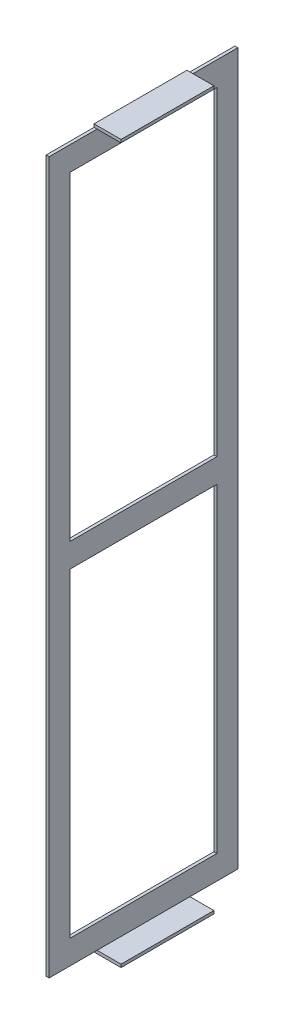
ISO-10303-21;
HEADER;
FILE_DESCRIPTION(('STEP AP214'),'2;1');
FILE_NAME('part.step','',(''),(''),'','','');
FILE_SCHEMA(('AUTOMOTIVE_DESIGN { 1 0 10303 214 1 1 1 1 }'));
ENDSEC;
DATA;
#1=APPLICATION_CONTEXT('core data for automotive mechanical design processes');
#2=APPLICATION_PROTOCOL_DEFINITION('international standard','automotive_design',2000,#1);
#3=PRODUCT_CONTEXT('',#1,'mechanical');
#4=PRODUCT('Part','Part','',(#3));
#5=PRODUCT_RELATED_PRODUCT_CATEGORY('part','',(#4));
#6=PRODUCT_DEFINITION_FORMATION('','',#4);
#7=PRODUCT_DEFINITION_CONTEXT('part definition',#1,'design');
#8=PRODUCT_DEFINITION('design','',#6,#7);
#9=PRODUCT_DEFINITION_SHAPE('','',#8);
#10=(LENGTH_UNIT() NAMED_UNIT(*) SI_UNIT(.MILLI.,.METRE.));
#11=(NAMED_UNIT(*) PLANE_ANGLE_UNIT() SI_UNIT($,.RADIAN.));
#12=(NAMED_UNIT(*) SI_UNIT($,.STERADIAN.) SOLID_ANGLE_UNIT());
#13=UNCERTAINTY_MEASURE_WITH_UNIT(LENGTH_MEASURE(1.E-05),#10,'distance_accuracy_value','');
#14=(GEOMETRIC_REPRESENTATION_CONTEXT(3) GLOBAL_UNCERTAINTY_ASSIGNED_CONTEXT((#13)) GLOBAL_UNIT_ASSIGNED_CONTEXT((#10,
#11,#12)) REPRESENTATION_CONTEXT('',''));
#15=CARTESIAN_POINT('',(0.,0.,0.));
#16=DIRECTION('',(0.,0.,1.));
#17=DIRECTION('',(1.,0.,0.));
#18=AXIS2_PLACEMENT_3D('',#15,#16,#17);
#19=CARTESIAN_POINT('',(0.,0.,0.));
#20=DIRECTION('',(0.,-1.,0.));
#21=DIRECTION('',(0.,0.,-1.));
#22=AXIS2_PLACEMENT_3D('',#19,#20,#21);
#23=PLANE('',#22);
#24=DIRECTION('',(0.,0.,-1.));
#25=VECTOR('',#24,1.);
#26=CARTESIAN_POINT('',(50.,0.,-50.));
#27=LINE('',#26,#25);
#28=CARTESIAN_POINT('',(50.,0.,50.));
#29=VERTEX_POINT('',#28);
#30=CARTESIAN_POINT('',(50.,0.,24.6));
#31=VERTEX_POINT('',#30);
#32=EDGE_CURVE('E275',#29,#31,#27,.T.);
#33=ORIENTED_EDGE('',*,*,#32,.T.);
#34=DIRECTION('',(1.,0.,0.));
#35=VECTOR('',#34,1.);
#36=CARTESIAN_POINT('',(50.,0.,24.6));
#37=LINE('',#36,#35);
#38=CARTESIAN_POINT('',(51.5875,0.,24.6));
#39=VERTEX_POINT('',#38);
#40=EDGE_CURVE('E222',#31,#39,#37,.T.);
#41=ORIENTED_EDGE('',*,*,#40,.T.);
#42=DIRECTION('',(0.,0.,-1.));
#43=VECTOR('',#42,1.);
#44=CARTESIAN_POINT('',(51.5875,0.,-51.5875));
#45=LINE('',#44,#43);
#46=CARTESIAN_POINT('',(51.5875,0.,50.));
#47=VERTEX_POINT('',#46);
#48=EDGE_CURVE('E265',#47,#39,#45,.T.);
#49=ORIENTED_EDGE('',*,*,#48,.F.);
#50=DIRECTION('',(1.,0.,0.));
#51=VECTOR('',#50,1.);
#52=CARTESIAN_POINT('',(-51.6,0.,50.));
#53=LINE('',#52,#51);
#54=EDGE_CURVE('E324',#29,#47,#53,.T.);
#55=ORIENTED_EDGE('',*,*,#54,.F.);
#56=EDGE_LOOP('',(#33,#41,#49,#55));
#57=FACE_BOUND('',#56,.T.);
#58=ADVANCED_FACE('F37',(#57),#23,.T.);
#59=CARTESIAN_POINT('',(51.5875,0.,-24.6));
#60=VERTEX_POINT('',#59);
#61=CARTESIAN_POINT('',(51.5875,0.,-50.));
#62=VERTEX_POINT('',#61);
#63=EDGE_CURVE('E258',#60,#62,#45,.T.);
#64=ORIENTED_EDGE('',*,*,#63,.F.);
#65=DIRECTION('',(-1.,0.,0.));
#66=VECTOR('',#65,1.);
#67=CARTESIAN_POINT('',(50.,0.,-24.6));
#68=LINE('',#67,#66);
#69=CARTESIAN_POINT('',(50.,0.,-24.6));
#70=VERTEX_POINT('',#69);
#71=EDGE_CURVE('E229',#60,#70,#68,.T.);
#72=ORIENTED_EDGE('',*,*,#71,.T.);
#73=CARTESIAN_POINT('',(50.,0.,-50.));
#74=VERTEX_POINT('',#73);
#75=EDGE_CURVE('E233',#70,#74,#27,.T.);
#76=ORIENTED_EDGE('',*,*,#75,.T.);
#77=DIRECTION('',(1.,0.,0.));
#78=VECTOR('',#77,1.);
#79=CARTESIAN_POINT('',(-51.6,0.,-50.));
#80=LINE('',#79,#78);
#81=EDGE_CURVE('E261',#74,#62,#80,.T.);
#82=ORIENTED_EDGE('',*,*,#81,.T.);
#83=EDGE_LOOP('',(#64,#72,#76,#82));
#84=FACE_BOUND('',#83,.T.);
#85=ADVANCED_FACE('F259',(#84),#23,.T.);
#86=CARTESIAN_POINT('',(51.5875,376.8,-51.5875));
#87=DIRECTION('',(-1.,0.,0.));
#88=DIRECTION('',(0.,0.,1.));
#89=AXIS2_PLACEMENT_3D('',#86,#87,#88);
#90=PLANE('',#89);
#91=DIRECTION('',(0.,1.,0.));
#92=VECTOR('',#91,1.);
#93=CARTESIAN_POINT('',(51.5875,364.1,-38.8875));
#94=LINE('',#93,#92);
#95=CARTESIAN_POINT('',(51.5875000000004,194.75,-38.8874999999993));
#96=VERTEX_POINT('',#95);
#97=CARTESIAN_POINT('',(51.5875,364.1,-38.8875));
#98=VERTEX_POINT('',#97);
#99=EDGE_CURVE('E359',#96,#98,#94,.T.);
#100=ORIENTED_EDGE('',*,*,#99,.F.);
#101=DIRECTION('',(0.,0.,-1.));
#102=VECTOR('',#101,1.);
#103=CARTESIAN_POINT('',(51.5875,194.75,5.40350380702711E-13));
#104=LINE('',#103,#102);
#105=CARTESIAN_POINT('',(51.5875,194.75,38.8875));
#106=VERTEX_POINT('',#105);
#107=EDGE_CURVE('E328',#106,#96,#104,.T.);
#108=ORIENTED_EDGE('',*,*,#107,.F.);
#109=DIRECTION('',(0.,-1.,0.));
#110=VECTOR('',#109,1.);
#111=CARTESIAN_POINT('',(51.5875,364.1,38.8875));
#112=LINE('',#111,#110);
#113=CARTESIAN_POINT('',(51.5875,364.1,38.8875));
#114=VERTEX_POINT('',#113);
#115=EDGE_CURVE('E354',#114,#106,#112,.T.);
#116=ORIENTED_EDGE('',*,*,#115,.F.);
#117=DIRECTION('',(0.,0.,1.));
#118=VECTOR('',#117,1.);
#119=CARTESIAN_POINT('',(51.5875,364.1,38.8875));
#120=LINE('',#119,#118);
#121=EDGE_CURVE('E362',#98,#114,#120,.T.);
#122=ORIENTED_EDGE('',*,*,#121,.F.);
#123=EDGE_LOOP('',(#100,#108,#116,#122));
#124=FACE_BOUND('',#123,.T.);
#125=DIRECTION('',(0.,0.,-1.));
#126=VECTOR('',#125,1.);
#127=CARTESIAN_POINT('',(51.5875,182.05,5.40350380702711E-13));
#128=LINE('',#127,#126);
#129=CARTESIAN_POINT('',(51.5874999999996,182.05,38.8875000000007));
#130=VERTEX_POINT('',#129);
#131=CARTESIAN_POINT('',(51.5875,182.05,-38.8875));
#132=VERTEX_POINT('',#131);
#133=EDGE_CURVE('E334',#130,#132,#128,.T.);
#134=ORIENTED_EDGE('',*,*,#133,.T.);
#135=CARTESIAN_POINT('',(51.5875,12.7,-38.8875));
#136=VERTEX_POINT('',#135);
#137=EDGE_CURVE('E360',#136,#132,#94,.T.);
#138=ORIENTED_EDGE('',*,*,#137,.F.);
#139=DIRECTION('',(0.,0.,-1.));
#140=VECTOR('',#139,1.);
#141=CARTESIAN_POINT('',(51.5875,12.7,38.8875));
#142=LINE('',#141,#140);
#143=CARTESIAN_POINT('',(51.5875,12.7,38.8875));
#144=VERTEX_POINT('',#143);
#145=EDGE_CURVE('E356',#144,#136,#142,.T.);
#146=ORIENTED_EDGE('',*,*,#145,.F.);
#147=EDGE_CURVE('E345',#130,#144,#112,.T.);
#148=ORIENTED_EDGE('',*,*,#147,.F.);
#149=EDGE_LOOP('',(#134,#138,#146,#148));
#150=FACE_BOUND('',#149,.T.);
#151=ORIENTED_EDGE('',*,*,#48,.T.);
#152=DIRECTION('',(0.,0.,-1.));
#153=VECTOR('',#152,1.);
#154=CARTESIAN_POINT('',(51.5875,0.,24.6));
#155=LINE('',#154,#153);
#156=EDGE_CURVE('E211',#39,#60,#155,.T.);
#157=ORIENTED_EDGE('',*,*,#156,.T.);
#158=ORIENTED_EDGE('',*,*,#63,.T.);
#159=DIRECTION('',(0.,-1.,0.));
#160=VECTOR('',#159,1.);
#161=CARTESIAN_POINT('',(51.5875,0.,-50.));
#162=LINE('',#161,#160);
#163=CARTESIAN_POINT('',(51.5875,376.8,-50.));
#164=VERTEX_POINT('',#163);
#165=EDGE_CURVE('E316',#164,#62,#162,.T.);
#166=ORIENTED_EDGE('',*,*,#165,.F.);
#167=DIRECTION('',(0.,0.,-1.));
#168=VECTOR('',#167,1.);
#169=CARTESIAN_POINT('',(51.5875,376.8,-51.5875));
#170=LINE('',#169,#168);
#171=CARTESIAN_POINT('',(51.5875,376.8,-24.6));
#172=VERTEX_POINT('',#171);
#173=EDGE_CURVE('E269',#172,#164,#170,.T.);
#174=ORIENTED_EDGE('',*,*,#173,.F.);
#175=DIRECTION('',(0.,0.,-1.));
#176=VECTOR('',#175,1.);
#177=CARTESIAN_POINT('',(51.5875,376.8,24.6));
#178=LINE('',#177,#176);
#179=CARTESIAN_POINT('',(51.5875,376.8,24.6));
#180=VERTEX_POINT('',#179);
#181=EDGE_CURVE('E237',#180,#172,#178,.T.);
#182=ORIENTED_EDGE('',*,*,#181,.F.);
#183=CARTESIAN_POINT('',(51.5875,376.8,50.));
#184=VERTEX_POINT('',#183);
#185=EDGE_CURVE('E284',#184,#180,#170,.T.);
#186=ORIENTED_EDGE('',*,*,#185,.F.);
#187=DIRECTION('',(0.,1.,0.));
#188=VECTOR('',#187,1.);
#189=CARTESIAN_POINT('',(51.5875,376.8,50.));
#190=LINE('',#189,#188);
#191=EDGE_CURVE('E318',#47,#184,#190,.T.);
#192=ORIENTED_EDGE('',*,*,#191,.F.);
#193=EDGE_LOOP('',(#151,#157,#158,#166,#174,#182,#186,#192));
#194=FACE_BOUND('',#193,.T.);
#195=ADVANCED_FACE('F39',(#124,#150,#194),#90,.F.);
#196=CARTESIAN_POINT('',(0.,376.8,0.));
#197=DIRECTION('',(0.,-1.,0.));
#198=DIRECTION('',(0.,0.,-1.));
#199=AXIS2_PLACEMENT_3D('',#196,#197,#198);
#200=PLANE('',#199);
#201=DIRECTION('',(-1.,0.,0.));
#202=VECTOR('',#201,1.);
#203=CARTESIAN_POINT('',(50.,376.8,-24.6));
#204=LINE('',#203,#202);
#205=CARTESIAN_POINT('',(50.,376.8,-24.6));
#206=VERTEX_POINT('',#205);
#207=EDGE_CURVE('E681',#172,#206,#204,.T.);
#208=ORIENTED_EDGE('',*,*,#207,.F.);
#209=ORIENTED_EDGE('',*,*,#173,.T.);
#210=DIRECTION('',(1.,0.,0.));
#211=VECTOR('',#210,1.);
#212=CARTESIAN_POINT('',(-51.6,376.8,-50.));
#213=LINE('',#212,#211);
#214=CARTESIAN_POINT('',(50.,376.8,-50.));
#215=VERTEX_POINT('',#214);
#216=EDGE_CURVE('E314',#215,#164,#213,.T.);
#217=ORIENTED_EDGE('',*,*,#216,.F.);
#218=DIRECTION('',(0.,0.,-1.));
#219=VECTOR('',#218,1.);
#220=CARTESIAN_POINT('',(50.,376.8,-50.));
#221=LINE('',#220,#219);
#222=EDGE_CURVE('E62',#206,#215,#221,.T.);
#223=ORIENTED_EDGE('',*,*,#222,.F.);
#224=EDGE_LOOP('',(#208,#209,#217,#223));
#225=FACE_BOUND('',#224,.T.);
#226=ADVANCED_FACE('F315',(#225),#200,.F.);
#227=DIRECTION('',(1.,0.,0.));
#228=VECTOR('',#227,1.);
#229=CARTESIAN_POINT('',(50.,376.8,24.6));
#230=LINE('',#229,#228);
#231=CARTESIAN_POINT('',(50.,376.8,24.6));
#232=VERTEX_POINT('',#231);
#233=EDGE_CURVE('E677',#232,#180,#230,.T.);
#234=ORIENTED_EDGE('',*,*,#233,.F.);
#235=CARTESIAN_POINT('',(50.,376.8,50.));
#236=VERTEX_POINT('',#235);
#237=EDGE_CURVE('E292',#236,#232,#221,.T.);
#238=ORIENTED_EDGE('',*,*,#237,.F.);
#239=DIRECTION('',(1.,0.,0.));
#240=VECTOR('',#239,1.);
#241=CARTESIAN_POINT('',(-51.6,376.8,50.));
#242=LINE('',#241,#240);
#243=EDGE_CURVE('E325',#236,#184,#242,.T.);
#244=ORIENTED_EDGE('',*,*,#243,.T.);
#245=ORIENTED_EDGE('',*,*,#185,.T.);
#246=EDGE_LOOP('',(#234,#238,#244,#245));
#247=FACE_BOUND('',#246,.T.);
#248=ADVANCED_FACE('F418',(#247),#200,.F.);
#249=CARTESIAN_POINT('',(-51.6,376.8,50.));
#250=DIRECTION('',(0.,0.,-1.));
#251=DIRECTION('',(-1.,0.,0.));
#252=AXIS2_PLACEMENT_3D('',#249,#250,#251);
#253=PLANE('',#252);
#254=DIRECTION('',(0.,-1.,0.));
#255=VECTOR('',#254,1.);
#256=CARTESIAN_POINT('',(50.,376.8,50.));
#257=LINE('',#256,#255);
#258=EDGE_CURVE('E266',#236,#29,#257,.T.);
#259=ORIENTED_EDGE('',*,*,#258,.T.);
#260=ORIENTED_EDGE('',*,*,#54,.T.);
#261=ORIENTED_EDGE('',*,*,#191,.T.);
#262=ORIENTED_EDGE('',*,*,#243,.F.);
#263=EDGE_LOOP('',(#259,#260,#261,#262));
#264=FACE_BOUND('',#263,.T.);
#265=ADVANCED_FACE('F407',(#264),#253,.F.);
#266=CARTESIAN_POINT('',(-51.6,364.1,38.8875));
#267=DIRECTION('',(0.,0.,1.));
#268=DIRECTION('',(1.,0.,0.));
#269=AXIS2_PLACEMENT_3D('',#266,#267,#268);
#270=PLANE('',#269);
#271=DIRECTION('',(1.,0.,0.));
#272=VECTOR('',#271,1.);
#273=CARTESIAN_POINT('',(49.9999999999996,194.75,38.8875000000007));
#274=LINE('',#273,#272);
#275=CARTESIAN_POINT('',(50.,194.75,38.8875));
#276=VERTEX_POINT('',#275);
#277=EDGE_CURVE('E337',#276,#106,#274,.T.);
#278=ORIENTED_EDGE('',*,*,#277,.F.);
#279=DIRECTION('',(0.,1.,0.));
#280=VECTOR('',#279,1.);
#281=CARTESIAN_POINT('',(50.,376.8,38.8875));
#282=LINE('',#281,#280);
#283=CARTESIAN_POINT('',(50.,364.1,38.8875));
#284=VERTEX_POINT('',#283);
#285=EDGE_CURVE('E46',#276,#284,#282,.T.);
#286=ORIENTED_EDGE('',*,*,#285,.T.);
#287=DIRECTION('',(1.,0.,0.));
#288=VECTOR('',#287,1.);
#289=CARTESIAN_POINT('',(-51.6,364.1,38.8875));
#290=LINE('',#289,#288);
#291=EDGE_CURVE('E365',#284,#114,#290,.T.);
#292=ORIENTED_EDGE('',*,*,#291,.T.);
#293=ORIENTED_EDGE('',*,*,#115,.T.);
#294=EDGE_LOOP('',(#278,#286,#292,#293));
#295=FACE_BOUND('',#294,.T.);
#296=ADVANCED_FACE('F394',(#295),#270,.F.);
#297=CARTESIAN_POINT('',(-51.6,364.1,38.8875));
#298=DIRECTION('',(0.,1.,0.));
#299=DIRECTION('',(0.,0.,1.));
#300=AXIS2_PLACEMENT_3D('',#297,#298,#299);
#301=PLANE('',#300);
#302=DIRECTION('',(0.,0.,-1.));
#303=VECTOR('',#302,1.);
#304=CARTESIAN_POINT('',(50.,364.1,-50.));
#305=LINE('',#304,#303);
#306=CARTESIAN_POINT('',(50.,364.1,-38.8875));
#307=VERTEX_POINT('',#306);
#308=EDGE_CURVE('E287',#284,#307,#305,.T.);
#309=ORIENTED_EDGE('',*,*,#308,.T.);
#310=DIRECTION('',(1.,0.,0.));
#311=VECTOR('',#310,1.);
#312=CARTESIAN_POINT('',(-51.6,364.1,-38.8875));
#313=LINE('',#312,#311);
#314=EDGE_CURVE('E367',#307,#98,#313,.T.);
#315=ORIENTED_EDGE('',*,*,#314,.T.);
#316=ORIENTED_EDGE('',*,*,#121,.T.);
#317=ORIENTED_EDGE('',*,*,#291,.F.);
#318=EDGE_LOOP('',(#309,#315,#316,#317));
#319=FACE_BOUND('',#318,.T.);
#320=ADVANCED_FACE('F406',(#319),#301,.F.);
#321=CARTESIAN_POINT('',(-51.6,364.1,-38.8875));
#322=DIRECTION('',(0.,0.,-1.));
#323=DIRECTION('',(-1.,0.,0.));
#324=AXIS2_PLACEMENT_3D('',#321,#322,#323);
#325=PLANE('',#324);
#326=DIRECTION('',(1.,0.,0.));
#327=VECTOR('',#326,1.);
#328=CARTESIAN_POINT('',(50.0000000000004,194.75,-38.8874999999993));
#329=LINE('',#328,#327);
#330=CARTESIAN_POINT('',(50.,194.75,-38.8875));
#331=VERTEX_POINT('',#330);
#332=EDGE_CURVE('E342',#331,#96,#329,.T.);
#333=ORIENTED_EDGE('',*,*,#332,.T.);
#334=ORIENTED_EDGE('',*,*,#99,.T.);
#335=ORIENTED_EDGE('',*,*,#314,.F.);
#336=DIRECTION('',(0.,-1.,0.));
#337=VECTOR('',#336,1.);
#338=CARTESIAN_POINT('',(50.,376.8,-38.8875));
#339=LINE('',#338,#337);
#340=EDGE_CURVE('E285',#307,#331,#339,.T.);
#341=ORIENTED_EDGE('',*,*,#340,.T.);
#342=EDGE_LOOP('',(#333,#334,#335,#341));
#343=FACE_BOUND('',#342,.T.);
#344=ADVANCED_FACE('F429',(#343),#325,.F.);
#345=CARTESIAN_POINT('',(50.,194.75,5.2372220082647E-13));
#346=DIRECTION('',(0.,-1.,0.));
#347=DIRECTION('',(0.,0.,-1.));
#348=AXIS2_PLACEMENT_3D('',#345,#346,#347);
#349=PLANE('',#348);
#350=ORIENTED_EDGE('',*,*,#107,.T.);
#351=ORIENTED_EDGE('',*,*,#332,.F.);
#352=DIRECTION('',(0.,0.,-1.));
#353=VECTOR('',#352,1.);
#354=CARTESIAN_POINT('',(50.,194.75,5.2372220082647E-13));
#355=LINE('',#354,#353);
#356=EDGE_CURVE('E330',#276,#331,#355,.T.);
#357=ORIENTED_EDGE('',*,*,#356,.F.);
#358=ORIENTED_EDGE('',*,*,#277,.T.);
#359=EDGE_LOOP('',(#350,#351,#357,#358));
#360=FACE_BOUND('',#359,.T.);
#361=ADVANCED_FACE('F402',(#360),#349,.F.);
#362=CARTESIAN_POINT('',(-51.6,12.7,38.8875));
#363=DIRECTION('',(0.,-1.,0.));
#364=DIRECTION('',(0.,0.,-1.));
#365=AXIS2_PLACEMENT_3D('',#362,#363,#364);
#366=PLANE('',#365);
#367=DIRECTION('',(0.,0.,1.));
#368=VECTOR('',#367,1.);
#369=CARTESIAN_POINT('',(50.,12.7,-50.));
#370=LINE('',#369,#368);
#371=CARTESIAN_POINT('',(50.,12.7,-38.8875));
#372=VERTEX_POINT('',#371);
#373=CARTESIAN_POINT('',(50.,12.7,38.8875));
#374=VERTEX_POINT('',#373);
#375=EDGE_CURVE('E280',#372,#374,#370,.T.);
#376=ORIENTED_EDGE('',*,*,#375,.T.);
#377=DIRECTION('',(1.,0.,0.));
#378=VECTOR('',#377,1.);
#379=CARTESIAN_POINT('',(-51.6,12.7,38.8875));
#380=LINE('',#379,#378);
#381=EDGE_CURVE('E299',#374,#144,#380,.T.);
#382=ORIENTED_EDGE('',*,*,#381,.T.);
#383=ORIENTED_EDGE('',*,*,#145,.T.);
#384=DIRECTION('',(1.,0.,0.));
#385=VECTOR('',#384,1.);
#386=CARTESIAN_POINT('',(-51.6,12.7,-38.8875));
#387=LINE('',#386,#385);
#388=EDGE_CURVE('E369',#372,#136,#387,.T.);
#389=ORIENTED_EDGE('',*,*,#388,.F.);
#390=EDGE_LOOP('',(#376,#382,#383,#389));
#391=FACE_BOUND('',#390,.T.);
#392=ADVANCED_FACE('F376',(#391),#366,.F.);
#393=CARTESIAN_POINT('',(50.,182.05,38.8875));
#394=VERTEX_POINT('',#393);
#395=EDGE_CURVE('E11',#374,#394,#282,.T.);
#396=ORIENTED_EDGE('',*,*,#395,.T.);
#397=DIRECTION('',(1.,0.,0.));
#398=VECTOR('',#397,1.);
#399=CARTESIAN_POINT('',(49.9999999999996,182.05,38.8875000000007));
#400=LINE('',#399,#398);
#401=EDGE_CURVE('E349',#394,#130,#400,.T.);
#402=ORIENTED_EDGE('',*,*,#401,.T.);
#403=ORIENTED_EDGE('',*,*,#147,.T.);
#404=ORIENTED_EDGE('',*,*,#381,.F.);
#405=EDGE_LOOP('',(#396,#402,#403,#404));
#406=FACE_BOUND('',#405,.T.);
#407=ADVANCED_FACE('F391',(#406),#270,.F.);
#408=CARTESIAN_POINT('',(50.,182.05,5.2372220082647E-13));
#409=DIRECTION('',(0.,-1.,0.));
#410=DIRECTION('',(0.,0.,-1.));
#411=AXIS2_PLACEMENT_3D('',#408,#409,#410);
#412=PLANE('',#411);
#413=ORIENTED_EDGE('',*,*,#133,.F.);
#414=ORIENTED_EDGE('',*,*,#401,.F.);
#415=DIRECTION('',(0.,0.,-1.));
#416=VECTOR('',#415,1.);
#417=CARTESIAN_POINT('',(50.,182.05,5.2372220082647E-13));
#418=LINE('',#417,#416);
#419=CARTESIAN_POINT('',(50.,182.05,-38.8875));
#420=VERTEX_POINT('',#419);
#421=EDGE_CURVE('E333',#394,#420,#418,.T.);
#422=ORIENTED_EDGE('',*,*,#421,.T.);
#423=DIRECTION('',(1.,0.,0.));
#424=VECTOR('',#423,1.);
#425=CARTESIAN_POINT('',(50.0000000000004,182.05,-38.8874999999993));
#426=LINE('',#425,#424);
#427=EDGE_CURVE('E346',#420,#132,#426,.T.);
#428=ORIENTED_EDGE('',*,*,#427,.T.);
#429=EDGE_LOOP('',(#413,#414,#422,#428));
#430=FACE_BOUND('',#429,.T.);
#431=ADVANCED_FACE('F386',(#430),#412,.T.);
#432=ORIENTED_EDGE('',*,*,#137,.T.);
#433=ORIENTED_EDGE('',*,*,#427,.F.);
#434=EDGE_CURVE('E283',#420,#372,#339,.T.);
#435=ORIENTED_EDGE('',*,*,#434,.T.);
#436=ORIENTED_EDGE('',*,*,#388,.T.);
#437=EDGE_LOOP('',(#432,#433,#435,#436));
#438=FACE_BOUND('',#437,.T.);
#439=ADVANCED_FACE('F383',(#438),#325,.F.);
#440=CARTESIAN_POINT('',(50.,376.8,-50.));
#441=DIRECTION('',(-1.,0.,0.));
#442=DIRECTION('',(0.,0.,1.));
#443=AXIS2_PLACEMENT_3D('',#440,#441,#442);
#444=PLANE('',#443);
#445=ORIENTED_EDGE('',*,*,#434,.F.);
#446=ORIENTED_EDGE('',*,*,#421,.F.);
#447=ORIENTED_EDGE('',*,*,#395,.F.);
#448=ORIENTED_EDGE('',*,*,#375,.F.);
#449=EDGE_LOOP('',(#445,#446,#447,#448));
#450=FACE_BOUND('',#449,.T.);
#451=ORIENTED_EDGE('',*,*,#356,.T.);
#452=ORIENTED_EDGE('',*,*,#340,.F.);
#453=ORIENTED_EDGE('',*,*,#308,.F.);
#454=ORIENTED_EDGE('',*,*,#285,.F.);
#455=EDGE_LOOP('',(#451,#452,#453,#454));
#456=FACE_BOUND('',#455,.T.);
#457=ORIENTED_EDGE('',*,*,#32,.F.);
#458=ORIENTED_EDGE('',*,*,#258,.F.);
#459=ORIENTED_EDGE('',*,*,#237,.T.);
#460=DIRECTION('',(0.,-1.,0.));
#461=VECTOR('',#460,1.);
#462=CARTESIAN_POINT('',(50.,378.3875,24.6));
#463=LINE('',#462,#461);
#464=CARTESIAN_POINT('',(50.,378.3875,24.6));
#465=VERTEX_POINT('',#464);
#466=EDGE_CURVE('E320',#465,#232,#463,.T.);
#467=ORIENTED_EDGE('',*,*,#466,.F.);
#468=DIRECTION('',(0.,0.,1.));
#469=VECTOR('',#468,1.);
#470=CARTESIAN_POINT('',(50.,378.3875,-24.6));
#471=LINE('',#470,#469);
#472=CARTESIAN_POINT('',(50.,378.3875,-24.6));
#473=VERTEX_POINT('',#472);
#474=EDGE_CURVE('E696',#473,#465,#471,.T.);
#475=ORIENTED_EDGE('',*,*,#474,.F.);
#476=DIRECTION('',(0.,-1.,0.));
#477=VECTOR('',#476,1.);
#478=CARTESIAN_POINT('',(50.,378.3875,-24.6));
#479=LINE('',#478,#477);
#480=EDGE_CURVE('E703',#473,#206,#479,.T.);
#481=ORIENTED_EDGE('',*,*,#480,.T.);
#482=ORIENTED_EDGE('',*,*,#222,.T.);
#483=DIRECTION('',(0.,-1.,0.));
#484=VECTOR('',#483,1.);
#485=CARTESIAN_POINT('',(50.,376.8,-50.));
#486=LINE('',#485,#484);
#487=EDGE_CURVE('E271',#215,#74,#486,.T.);
#488=ORIENTED_EDGE('',*,*,#487,.T.);
#489=ORIENTED_EDGE('',*,*,#75,.F.);
#490=DIRECTION('',(0.,1.,0.));
#491=VECTOR('',#490,1.);
#492=CARTESIAN_POINT('',(50.,-1.5875,-24.6));
#493=LINE('',#492,#491);
#494=CARTESIAN_POINT('',(50.,-1.5875,-24.6));
#495=VERTEX_POINT('',#494);
#496=EDGE_CURVE('E54',#495,#70,#493,.T.);
#497=ORIENTED_EDGE('',*,*,#496,.F.);
#498=DIRECTION('',(0.,0.,1.));
#499=VECTOR('',#498,1.);
#500=CARTESIAN_POINT('',(50.,-1.5875,-24.6));
#501=LINE('',#500,#499);
#502=CARTESIAN_POINT('',(50.,-1.5875,24.6));
#503=VERTEX_POINT('',#502);
#504=EDGE_CURVE('E220',#495,#503,#501,.T.);
#505=ORIENTED_EDGE('',*,*,#504,.T.);
#506=DIRECTION('',(0.,1.,0.));
#507=VECTOR('',#506,1.);
#508=CARTESIAN_POINT('',(50.,-1.5875,24.6));
#509=LINE('',#508,#507);
#510=EDGE_CURVE('E196',#503,#31,#509,.T.);
#511=ORIENTED_EDGE('',*,*,#510,.T.);
#512=EDGE_LOOP('',(#457,#458,#459,#467,#475,#481,#482,#488,#489,#497,#505,#511));
#513=FACE_BOUND('',#512,.T.);
#514=ADVANCED_FACE('F309',(#450,#456,#513),#444,.T.);
#515=CARTESIAN_POINT('',(-51.6,0.,-50.));
#516=DIRECTION('',(0.,0.,1.));
#517=DIRECTION('',(1.,0.,0.));
#518=AXIS2_PLACEMENT_3D('',#515,#516,#517);
#519=PLANE('',#518);
#520=ORIENTED_EDGE('',*,*,#487,.F.);
#521=ORIENTED_EDGE('',*,*,#216,.T.);
#522=ORIENTED_EDGE('',*,*,#165,.T.);
#523=ORIENTED_EDGE('',*,*,#81,.F.);
#524=EDGE_LOOP('',(#520,#521,#522,#523));
#525=FACE_BOUND('',#524,.T.);
#526=ADVANCED_FACE('F313',(#525),#519,.F.);
#527=CARTESIAN_POINT('',(50.,378.3875,24.6));
#528=DIRECTION('',(0.,0.,-1.));
#529=DIRECTION('',(-1.,0.,0.));
#530=AXIS2_PLACEMENT_3D('',#527,#528,#529);
#531=PLANE('',#530);
#532=ORIENTED_EDGE('',*,*,#233,.T.);
#533=DIRECTION('',(-1.,0.,0.));
#534=VECTOR('',#533,1.);
#535=CARTESIAN_POINT('',(64.2875,376.8,24.6));
#536=LINE('',#535,#534);
#537=CARTESIAN_POINT('',(64.2875,376.8,24.6));
#538=VERTEX_POINT('',#537);
#539=EDGE_CURVE('E675',#538,#180,#536,.T.);
#540=ORIENTED_EDGE('',*,*,#539,.F.);
#541=DIRECTION('',(0.,-1.,0.));
#542=VECTOR('',#541,1.);
#543=CARTESIAN_POINT('',(64.2875,378.3875,24.6));
#544=LINE('',#543,#542);
#545=CARTESIAN_POINT('',(64.2875,378.3875,24.6));
#546=VERTEX_POINT('',#545);
#547=EDGE_CURVE('E666',#546,#538,#544,.T.);
#548=ORIENTED_EDGE('',*,*,#547,.F.);
#549=DIRECTION('',(1.,0.,0.));
#550=VECTOR('',#549,1.);
#551=CARTESIAN_POINT('',(50.,378.3875,24.6));
#552=LINE('',#551,#550);
#553=EDGE_CURVE('E699',#465,#546,#552,.T.);
#554=ORIENTED_EDGE('',*,*,#553,.F.);
#555=ORIENTED_EDGE('',*,*,#466,.T.);
#556=EDGE_LOOP('',(#532,#540,#548,#554,#555));
#557=FACE_BOUND('',#556,.T.);
#558=ADVANCED_FACE('F425',(#557),#531,.F.);
#559=CARTESIAN_POINT('',(50.,378.3875,-24.6));
#560=DIRECTION('',(0.,0.,1.));
#561=DIRECTION('',(1.,0.,0.));
#562=AXIS2_PLACEMENT_3D('',#559,#560,#561);
#563=PLANE('',#562);
#564=ORIENTED_EDGE('',*,*,#207,.T.);
#565=ORIENTED_EDGE('',*,*,#480,.F.);
#566=DIRECTION('',(-1.,0.,0.));
#567=VECTOR('',#566,1.);
#568=CARTESIAN_POINT('',(50.,378.3875,-24.6));
#569=LINE('',#568,#567);
#570=CARTESIAN_POINT('',(64.2875,378.3875,-24.6));
#571=VERTEX_POINT('',#570);
#572=EDGE_CURVE('E701',#571,#473,#569,.T.);
#573=ORIENTED_EDGE('',*,*,#572,.F.);
#574=DIRECTION('',(0.,1.,0.));
#575=VECTOR('',#574,1.);
#576=CARTESIAN_POINT('',(64.2875,378.3875,-24.6));
#577=LINE('',#576,#575);
#578=CARTESIAN_POINT('',(64.2875,376.8,-24.6));
#579=VERTEX_POINT('',#578);
#580=EDGE_CURVE('E721',#579,#571,#577,.T.);
#581=ORIENTED_EDGE('',*,*,#580,.F.);
#582=DIRECTION('',(-1.,0.,0.));
#583=VECTOR('',#582,1.);
#584=CARTESIAN_POINT('',(64.2875,376.8,-24.6));
#585=LINE('',#584,#583);
#586=EDGE_CURVE('E679',#579,#172,#585,.T.);
#587=ORIENTED_EDGE('',*,*,#586,.T.);
#588=EDGE_LOOP('',(#564,#565,#573,#581,#587));
#589=FACE_BOUND('',#588,.T.);
#590=ADVANCED_FACE('F554',(#589),#563,.F.);
#591=CARTESIAN_POINT('',(0.,378.3875,0.));
#592=DIRECTION('',(0.,1.,0.));
#593=DIRECTION('',(0.,0.,1.));
#594=AXIS2_PLACEMENT_3D('',#591,#592,#593);
#595=PLANE('',#594);
#596=ORIENTED_EDGE('',*,*,#474,.T.);
#597=ORIENTED_EDGE('',*,*,#553,.T.);
#598=DIRECTION('',(0.,0.,1.));
#599=VECTOR('',#598,1.);
#600=CARTESIAN_POINT('',(64.2875,378.3875,24.6));
#601=LINE('',#600,#599);
#602=EDGE_CURVE('E672',#571,#546,#601,.T.);
#603=ORIENTED_EDGE('',*,*,#602,.F.);
#604=ORIENTED_EDGE('',*,*,#572,.T.);
#605=EDGE_LOOP('',(#596,#597,#603,#604));
#606=FACE_BOUND('',#605,.T.);
#607=ADVANCED_FACE('F565',(#606),#595,.T.);
#608=CARTESIAN_POINT('',(64.2875,376.8,24.6));
#609=DIRECTION('',(0.,1.,0.));
#610=DIRECTION('',(0.,0.,1.));
#611=AXIS2_PLACEMENT_3D('',#608,#609,#610);
#612=PLANE('',#611);
#613=ORIENTED_EDGE('',*,*,#181,.T.);
#614=ORIENTED_EDGE('',*,*,#586,.F.);
#615=DIRECTION('',(0.,0.,-1.));
#616=VECTOR('',#615,1.);
#617=CARTESIAN_POINT('',(64.2875,376.8,24.6));
#618=LINE('',#617,#616);
#619=EDGE_CURVE('E669',#538,#579,#618,.T.);
#620=ORIENTED_EDGE('',*,*,#619,.F.);
#621=ORIENTED_EDGE('',*,*,#539,.T.);
#622=EDGE_LOOP('',(#613,#614,#620,#621));
#623=FACE_BOUND('',#622,.T.);
#624=ADVANCED_FACE('F576',(#623),#612,.F.);
#625=CARTESIAN_POINT('',(64.2875,0.,0.));
#626=DIRECTION('',(1.,0.,0.));
#627=DIRECTION('',(0.,0.,-1.));
#628=AXIS2_PLACEMENT_3D('',#625,#626,#627);
#629=PLANE('',#628);
#630=ORIENTED_EDGE('',*,*,#547,.T.);
#631=ORIENTED_EDGE('',*,*,#619,.T.);
#632=ORIENTED_EDGE('',*,*,#580,.T.);
#633=ORIENTED_EDGE('',*,*,#602,.T.);
#634=EDGE_LOOP('',(#630,#631,#632,#633));
#635=FACE_BOUND('',#634,.T.);
#636=ADVANCED_FACE('F597',(#635),#629,.T.);
#637=CARTESIAN_POINT('',(50.,-1.5875,-24.6));
#638=DIRECTION('',(0.,0.,-1.));
#639=DIRECTION('',(-1.,0.,0.));
#640=AXIS2_PLACEMENT_3D('',#637,#638,#639);
#641=PLANE('',#640);
#642=ORIENTED_EDGE('',*,*,#71,.F.);
#643=DIRECTION('',(-1.,0.,0.));
#644=VECTOR('',#643,1.);
#645=CARTESIAN_POINT('',(64.2875,0.,-24.6));
#646=LINE('',#645,#644);
#647=CARTESIAN_POINT('',(64.2875,0.,-24.6));
#648=VERTEX_POINT('',#647);
#649=EDGE_CURVE('E232',#648,#60,#646,.T.);
#650=ORIENTED_EDGE('',*,*,#649,.F.);
#651=DIRECTION('',(0.,-1.,0.));
#652=VECTOR('',#651,1.);
#653=CARTESIAN_POINT('',(64.2875,-1.58750000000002,-24.6));
#654=LINE('',#653,#652);
#655=CARTESIAN_POINT('',(64.2875,-1.58750000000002,-24.6));
#656=VERTEX_POINT('',#655);
#657=EDGE_CURVE('E214',#648,#656,#654,.T.);
#658=ORIENTED_EDGE('',*,*,#657,.T.);
#659=DIRECTION('',(-1.,0.,0.));
#660=VECTOR('',#659,1.);
#661=CARTESIAN_POINT('',(50.,-1.5875,-24.6));
#662=LINE('',#661,#660);
#663=EDGE_CURVE('E201',#656,#495,#662,.T.);
#664=ORIENTED_EDGE('',*,*,#663,.T.);
#665=ORIENTED_EDGE('',*,*,#496,.T.);
#666=EDGE_LOOP('',(#642,#650,#658,#664,#665));
#667=FACE_BOUND('',#666,.T.);
#668=ADVANCED_FACE('F253',(#667),#641,.T.);
#669=CARTESIAN_POINT('',(50.,-1.5875,24.6));
#670=DIRECTION('',(0.,0.,1.));
#671=DIRECTION('',(1.,0.,0.));
#672=AXIS2_PLACEMENT_3D('',#669,#670,#671);
#673=PLANE('',#672);
#674=ORIENTED_EDGE('',*,*,#40,.F.);
#675=ORIENTED_EDGE('',*,*,#510,.F.);
#676=DIRECTION('',(1.,0.,0.));
#677=VECTOR('',#676,1.);
#678=CARTESIAN_POINT('',(50.,-1.5875,24.6));
#679=LINE('',#678,#677);
#680=CARTESIAN_POINT('',(64.2875,-1.58750000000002,24.6));
#681=VERTEX_POINT('',#680);
#682=EDGE_CURVE('E189',#503,#681,#679,.T.);
#683=ORIENTED_EDGE('',*,*,#682,.T.);
#684=DIRECTION('',(0.,1.,0.));
#685=VECTOR('',#684,1.);
#686=CARTESIAN_POINT('',(64.2875,-1.58750000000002,24.6));
#687=LINE('',#686,#685);
#688=CARTESIAN_POINT('',(64.2875,0.,24.6));
#689=VERTEX_POINT('',#688);
#690=EDGE_CURVE('E194',#681,#689,#687,.T.);
#691=ORIENTED_EDGE('',*,*,#690,.T.);
#692=DIRECTION('',(-1.,0.,0.));
#693=VECTOR('',#692,1.);
#694=CARTESIAN_POINT('',(64.2875,0.,24.6));
#695=LINE('',#694,#693);
#696=EDGE_CURVE('E219',#689,#39,#695,.T.);
#697=ORIENTED_EDGE('',*,*,#696,.T.);
#698=EDGE_LOOP('',(#674,#675,#683,#691,#697));
#699=FACE_BOUND('',#698,.T.);
#700=ADVANCED_FACE('F192',(#699),#673,.T.);
#701=CARTESIAN_POINT('',(0.,-1.5875,0.));
#702=DIRECTION('',(0.,-1.,0.));
#703=DIRECTION('',(0.,0.,1.));
#704=AXIS2_PLACEMENT_3D('',#701,#702,#703);
#705=PLANE('',#704);
#706=ORIENTED_EDGE('',*,*,#504,.F.);
#707=ORIENTED_EDGE('',*,*,#663,.F.);
#708=DIRECTION('',(0.,0.,1.));
#709=VECTOR('',#708,1.);
#710=CARTESIAN_POINT('',(64.2875,-1.58750000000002,24.6));
#711=LINE('',#710,#709);
#712=EDGE_CURVE('E207',#656,#681,#711,.T.);
#713=ORIENTED_EDGE('',*,*,#712,.T.);
#714=ORIENTED_EDGE('',*,*,#682,.F.);
#715=EDGE_LOOP('',(#706,#707,#713,#714));
#716=FACE_BOUND('',#715,.T.);
#717=ADVANCED_FACE('F213',(#716),#705,.T.);
#718=CARTESIAN_POINT('',(64.2875,0.,24.6));
#719=DIRECTION('',(0.,1.,0.));
#720=DIRECTION('',(0.,0.,1.));
#721=AXIS2_PLACEMENT_3D('',#718,#719,#720);
#722=PLANE('',#721);
#723=ORIENTED_EDGE('',*,*,#156,.F.);
#724=ORIENTED_EDGE('',*,*,#696,.F.);
#725=DIRECTION('',(0.,0.,-1.));
#726=VECTOR('',#725,1.);
#727=CARTESIAN_POINT('',(64.2875,0.,24.6));
#728=LINE('',#727,#726);
#729=EDGE_CURVE('E210',#689,#648,#728,.T.);
#730=ORIENTED_EDGE('',*,*,#729,.T.);
#731=ORIENTED_EDGE('',*,*,#649,.T.);
#732=EDGE_LOOP('',(#723,#724,#730,#731));
#733=FACE_BOUND('',#732,.T.);
#734=ADVANCED_FACE('F252',(#733),#722,.T.);
#735=CARTESIAN_POINT('',(64.2875,376.8,0.));
#736=DIRECTION('',(1.,0.,0.));
#737=DIRECTION('',(0.,0.,-1.));
#738=AXIS2_PLACEMENT_3D('',#735,#736,#737);
#739=PLANE('',#738);
#740=ORIENTED_EDGE('',*,*,#690,.F.);
#741=ORIENTED_EDGE('',*,*,#712,.F.);
#742=ORIENTED_EDGE('',*,*,#657,.F.);
#743=ORIENTED_EDGE('',*,*,#729,.F.);
#744=EDGE_LOOP('',(#740,#741,#742,#743));
#745=FACE_BOUND('',#744,.T.);
#746=ADVANCED_FACE('F205',(#745),#739,.T.);
#747=CLOSED_SHELL('',(#58,#85,#195,#226,#248,#265,#296,#320,#344,#361,#392,#407,#431,#439,#514,
#526,#558,#590,#607,#624,#636,#668,#700,#717,#734,#746));
#748=MANIFOLD_SOLID_BREP('B2',#747);
#749=ADVANCED_BREP_SHAPE_REPRESENTATION('',(#18,#748),#14);
#750=SHAPE_DEFINITION_REPRESENTATION(#9,#749);
ENDSEC;
END-ISO-10303-21;
